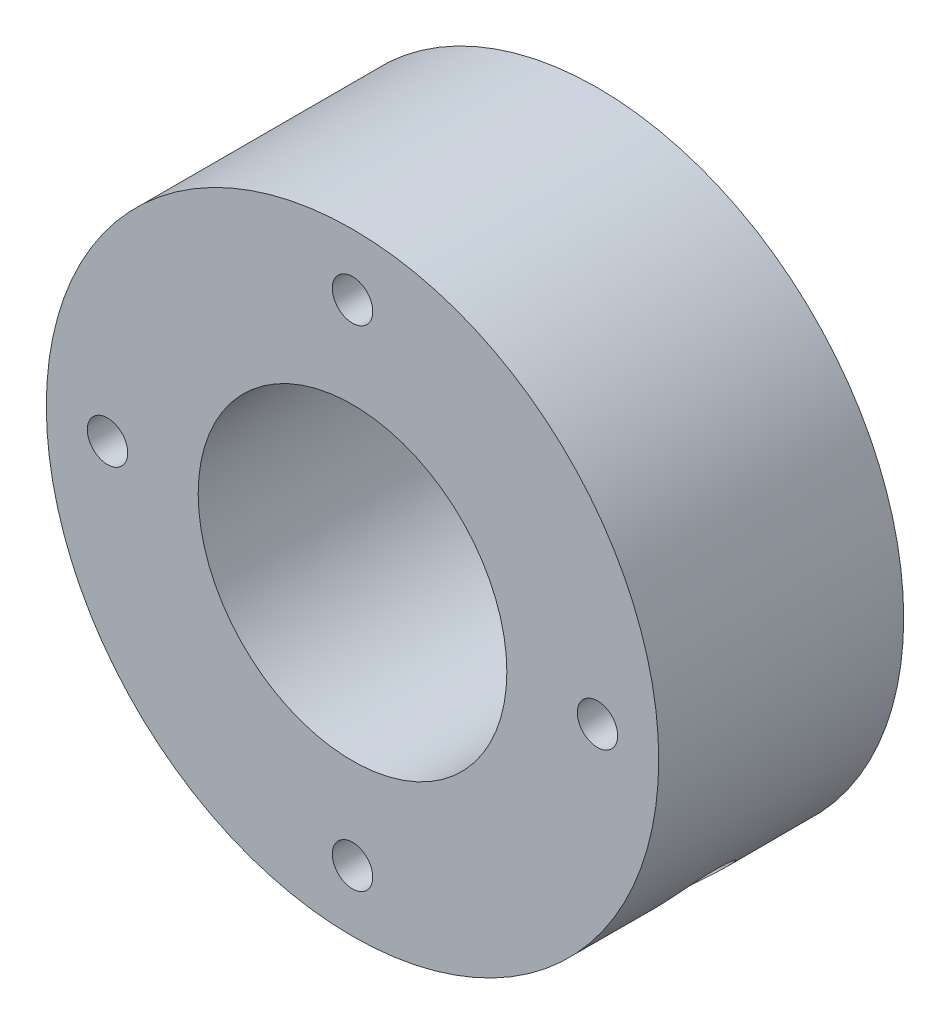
ISO-10303-21;
HEADER;
FILE_DESCRIPTION(('STEP AP214'),'2;1');
FILE_NAME('part.step','',(''),(''),'','','');
FILE_SCHEMA(('AUTOMOTIVE_DESIGN { 1 0 10303 214 1 1 1 1 }'));
ENDSEC;
DATA;
#1=APPLICATION_CONTEXT('core data for automotive mechanical design processes');
#2=APPLICATION_PROTOCOL_DEFINITION('international standard','automotive_design',2000,#1);
#3=PRODUCT_CONTEXT('',#1,'mechanical');
#4=PRODUCT('Part','Part','',(#3));
#5=PRODUCT_RELATED_PRODUCT_CATEGORY('part','',(#4));
#6=PRODUCT_DEFINITION_FORMATION('','',#4);
#7=PRODUCT_DEFINITION_CONTEXT('part definition',#1,'design');
#8=PRODUCT_DEFINITION('design','',#6,#7);
#9=PRODUCT_DEFINITION_SHAPE('','',#8);
#10=(LENGTH_UNIT() NAMED_UNIT(*) SI_UNIT(.MILLI.,.METRE.));
#11=(NAMED_UNIT(*) PLANE_ANGLE_UNIT() SI_UNIT($,.RADIAN.));
#12=(NAMED_UNIT(*) SI_UNIT($,.STERADIAN.) SOLID_ANGLE_UNIT());
#13=UNCERTAINTY_MEASURE_WITH_UNIT(LENGTH_MEASURE(1.E-05),#10,'distance_accuracy_value','');
#14=(GEOMETRIC_REPRESENTATION_CONTEXT(3) GLOBAL_UNCERTAINTY_ASSIGNED_CONTEXT((#13)) GLOBAL_UNIT_ASSIGNED_CONTEXT((#10,
#11,#12)) REPRESENTATION_CONTEXT('',''));
#15=CARTESIAN_POINT('',(0.,0.,0.));
#16=DIRECTION('',(0.,0.,1.));
#17=DIRECTION('',(1.,0.,0.));
#18=AXIS2_PLACEMENT_3D('',#15,#16,#17);
#19=CARTESIAN_POINT('',(0.,0.,20.));
#20=DIRECTION('',(0.,0.,1.));
#21=DIRECTION('',(1.,0.,0.));
#22=AXIS2_PLACEMENT_3D('',#19,#20,#21);
#23=PLANE('',#22);
#24=CARTESIAN_POINT('',(-20.,0.,20.));
#25=DIRECTION('',(0.,0.,1.));
#26=DIRECTION('',(1.,0.,0.));
#27=AXIS2_PLACEMENT_3D('',#24,#25,#26);
#28=CIRCLE('',#27,1.65);
#29=CARTESIAN_POINT('',(-18.35,0.,20.));
#30=VERTEX_POINT('',#29);
#31=EDGE_CURVE('E74',#30,#30,#28,.T.);
#32=ORIENTED_EDGE('',*,*,#31,.F.);
#33=EDGE_LOOP('',(#32));
#34=FACE_BOUND('',#33,.T.);
#35=CARTESIAN_POINT('',(0.,-20.,20.));
#36=DIRECTION('',(0.,0.,1.));
#37=DIRECTION('',(1.,0.,0.));
#38=AXIS2_PLACEMENT_3D('',#35,#36,#37);
#39=CIRCLE('',#38,1.65);
#40=CARTESIAN_POINT('',(1.65,-20.,20.));
#41=VERTEX_POINT('',#40);
#42=EDGE_CURVE('E68',#41,#41,#39,.T.);
#43=ORIENTED_EDGE('',*,*,#42,.F.);
#44=EDGE_LOOP('',(#43));
#45=FACE_BOUND('',#44,.T.);
#46=CARTESIAN_POINT('',(20.,0.,20.));
#47=DIRECTION('',(0.,0.,1.));
#48=DIRECTION('',(1.,0.,0.));
#49=AXIS2_PLACEMENT_3D('',#46,#47,#48);
#50=CIRCLE('',#49,1.65);
#51=CARTESIAN_POINT('',(21.65,0.,20.));
#52=VERTEX_POINT('',#51);
#53=EDGE_CURVE('E62',#52,#52,#50,.T.);
#54=ORIENTED_EDGE('',*,*,#53,.F.);
#55=EDGE_LOOP('',(#54));
#56=FACE_BOUND('',#55,.T.);
#57=CARTESIAN_POINT('',(0.,20.,20.));
#58=DIRECTION('',(0.,0.,1.));
#59=DIRECTION('',(1.,0.,0.));
#60=AXIS2_PLACEMENT_3D('',#57,#58,#59);
#61=CIRCLE('',#60,1.65);
#62=CARTESIAN_POINT('',(1.65,20.,20.));
#63=VERTEX_POINT('',#62);
#64=EDGE_CURVE('E56',#63,#63,#61,.T.);
#65=ORIENTED_EDGE('',*,*,#64,.F.);
#66=EDGE_LOOP('',(#65));
#67=FACE_BOUND('',#66,.T.);
#68=CARTESIAN_POINT('',(0.,0.,20.));
#69=DIRECTION('',(0.,0.,1.));
#70=DIRECTION('',(1.,0.,0.));
#71=AXIS2_PLACEMENT_3D('',#68,#69,#70);
#72=CIRCLE('',#71,25.);
#73=CARTESIAN_POINT('',(25.,0.,20.));
#74=VERTEX_POINT('',#73);
#75=EDGE_CURVE('E10',#74,#74,#72,.T.);
#76=ORIENTED_EDGE('',*,*,#75,.T.);
#77=EDGE_LOOP('',(#76));
#78=FACE_BOUND('',#77,.T.);
#79=CARTESIAN_POINT('',(0.,0.,20.));
#80=DIRECTION('',(0.,0.,1.));
#81=DIRECTION('',(1.,0.,0.));
#82=AXIS2_PLACEMENT_3D('',#79,#80,#81);
#83=CIRCLE('',#82,12.6000000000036);
#84=CARTESIAN_POINT('',(12.6000000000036,0.,20.));
#85=VERTEX_POINT('',#84);
#86=EDGE_CURVE('E48',#85,#85,#83,.T.);
#87=ORIENTED_EDGE('',*,*,#86,.F.);
#88=EDGE_LOOP('',(#87));
#89=FACE_BOUND('',#88,.T.);
#90=ADVANCED_FACE('F30',(#34,#45,#56,#67,#78,#89),#23,.T.);
#91=CARTESIAN_POINT('',(0.,0.,0.));
#92=DIRECTION('',(0.,0.,1.));
#93=DIRECTION('',(1.,0.,0.));
#94=AXIS2_PLACEMENT_3D('',#91,#92,#93);
#95=PLANE('',#94);
#96=CARTESIAN_POINT('',(0.,0.,0.));
#97=DIRECTION('',(0.,0.,1.));
#98=DIRECTION('',(1.,0.,0.));
#99=AXIS2_PLACEMENT_3D('',#96,#97,#98);
#100=CIRCLE('',#99,25.);
#101=CARTESIAN_POINT('',(25.,0.,0.));
#102=VERTEX_POINT('',#101);
#103=EDGE_CURVE('E43',#102,#102,#100,.T.);
#104=ORIENTED_EDGE('',*,*,#103,.F.);
#105=EDGE_LOOP('',(#104));
#106=FACE_BOUND('',#105,.T.);
#107=CARTESIAN_POINT('',(0.,0.,0.));
#108=DIRECTION('',(0.,0.,1.));
#109=DIRECTION('',(1.,0.,0.));
#110=AXIS2_PLACEMENT_3D('',#107,#108,#109);
#111=CIRCLE('',#110,12.6000000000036);
#112=CARTESIAN_POINT('',(12.6000000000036,0.,0.));
#113=VERTEX_POINT('',#112);
#114=EDGE_CURVE('E50',#113,#113,#111,.T.);
#115=ORIENTED_EDGE('',*,*,#114,.T.);
#116=EDGE_LOOP('',(#115));
#117=FACE_BOUND('',#116,.T.);
#118=ADVANCED_FACE('F126',(#106,#117),#95,.F.);
#119=CARTESIAN_POINT('',(0.,0.,20.));
#120=DIRECTION('',(0.,0.,-1.));
#121=DIRECTION('',(-1.,0.,0.));
#122=AXIS2_PLACEMENT_3D('',#119,#120,#121);
#123=CYLINDRICAL_SURFACE('',#122,25.);
#124=CARTESIAN_POINT('',(19.6712491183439,-15.4286084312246,10.));
#125=CARTESIAN_POINT('',(19.6712456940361,-15.4286151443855,9.83214085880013));
#126=CARTESIAN_POINT('',(19.6624706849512,-15.4398211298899,9.66417547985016));
#127=CARTESIAN_POINT('',(19.62750207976,-15.4842478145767,9.33291538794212));
#128=CARTESIAN_POINT('',(19.6012900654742,-15.5174917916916,9.16962580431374));
#129=CARTESIAN_POINT('',(19.5319302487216,-15.6047039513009,8.85256159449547));
#130=CARTESIAN_POINT('',(19.488793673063,-15.6586583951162,8.69878073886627));
#131=CARTESIAN_POINT('',(19.3863779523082,-15.7852763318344,8.40495285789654));
#132=CARTESIAN_POINT('',(19.3271016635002,-15.8579365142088,8.26490340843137));
#133=CARTESIAN_POINT('',(19.1931983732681,-16.0197435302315,8.0017602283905));
#134=CARTESIAN_POINT('',(19.1185018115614,-16.1089648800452,7.87874770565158));
#135=CARTESIAN_POINT('',(18.9553987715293,-16.3005722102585,7.65387128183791));
#136=CARTESIAN_POINT('',(18.8669916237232,-16.4029588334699,7.55200841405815));
#137=CARTESIAN_POINT('',(18.6780537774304,-16.6177856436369,7.37203346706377));
#138=CARTESIAN_POINT('',(18.5774870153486,-16.7302554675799,7.29399458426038));
#139=CARTESIAN_POINT('',(18.3667824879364,-16.9613006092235,7.16435153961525));
#140=CARTESIAN_POINT('',(18.2566450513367,-17.0798757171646,7.11274647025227));
#141=CARTESIAN_POINT('',(18.03013863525,-17.3188063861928,7.03767774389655));
#142=CARTESIAN_POINT('',(17.9138023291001,-17.4391505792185,7.01407934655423));
#143=CARTESIAN_POINT('',(17.6775782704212,-17.6785604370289,6.99527640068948));
#144=CARTESIAN_POINT('',(17.5576906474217,-17.7976261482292,7.00007081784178));
#145=CARTESIAN_POINT('',(17.3184583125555,-18.0304945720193,7.03780912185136));
#146=CARTESIAN_POINT('',(17.199113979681,-18.1443212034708,7.07060810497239));
#147=CARTESIAN_POINT('',(16.963947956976,-18.3643791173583,7.163198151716));
#148=CARTESIAN_POINT('',(16.8481263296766,-18.4706102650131,7.22298969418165));
#149=CARTESIAN_POINT('',(16.6233568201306,-18.6731619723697,7.36802272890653));
#150=CARTESIAN_POINT('',(16.5144267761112,-18.7694571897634,7.45332723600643));
#151=CARTESIAN_POINT('',(16.3072960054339,-18.9496959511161,7.64691889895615));
#152=CARTESIAN_POINT('',(16.2090957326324,-19.0336389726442,7.75520702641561));
#153=CARTESIAN_POINT('',(16.0261533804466,-19.1879349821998,7.99250434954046));
#154=CARTESIAN_POINT('',(15.9414999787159,-19.2581990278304,8.1216397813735));
#155=CARTESIAN_POINT('',(15.7893950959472,-19.3831039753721,8.39653151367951));
#156=CARTESIAN_POINT('',(15.7219436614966,-19.4377448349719,8.54228785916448));
#157=CARTESIAN_POINT('',(15.6066969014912,-19.5303995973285,8.84639249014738));
#158=CARTESIAN_POINT('',(15.5589088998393,-19.5684073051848,9.00474544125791));
#159=CARTESIAN_POINT('',(15.4848484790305,-19.627066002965,9.32949235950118));
#160=CARTESIAN_POINT('',(15.4585751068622,-19.6477177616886,9.4958859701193));
#161=CARTESIAN_POINT('',(15.4286617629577,-19.6712165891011,9.83088309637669));
#162=CARTESIAN_POINT('',(15.4248820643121,-19.6741735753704,9.99946643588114));
#163=CARTESIAN_POINT('',(15.4397298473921,-19.6625234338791,10.3350287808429));
#164=CARTESIAN_POINT('',(15.4583568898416,-19.64791665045,10.5020078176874));
#165=CARTESIAN_POINT('',(15.5172014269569,-19.6014755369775,10.829095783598));
#166=CARTESIAN_POINT('',(15.55735202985,-19.5696945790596,10.9892243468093));
#167=CARTESIAN_POINT('',(15.6576839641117,-19.489510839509,11.298679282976));
#168=CARTESIAN_POINT('',(15.7178659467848,-19.441107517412,11.448005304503));
#169=CARTESIAN_POINT('',(15.8563998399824,-19.3282842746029,11.7324162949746));
#170=CARTESIAN_POINT('',(15.9348389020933,-19.2637874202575,11.8674282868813));
#171=CARTESIAN_POINT('',(16.1069402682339,-19.1201205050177,12.1186351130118));
#172=CARTESIAN_POINT('',(16.2006031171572,-19.0409499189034,12.2348292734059));
#173=CARTESIAN_POINT('',(16.4004726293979,-18.8690732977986,12.4457197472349));
#174=CARTESIAN_POINT('',(16.5067424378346,-18.7762985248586,12.5403002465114));
#175=CARTESIAN_POINT('',(16.7278772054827,-18.5795585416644,12.7044782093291));
#176=CARTESIAN_POINT('',(16.8427420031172,-18.4755935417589,12.7740761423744));
#177=CARTESIAN_POINT('',(17.0770592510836,-18.2592275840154,12.8861210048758));
#178=CARTESIAN_POINT('',(17.196499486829,-18.1468484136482,12.9286355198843));
#179=CARTESIAN_POINT('',(17.4365252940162,-17.9163404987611,12.9855267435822));
#180=CARTESIAN_POINT('',(17.5571108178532,-17.7982119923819,12.9999046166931));
#181=CARTESIAN_POINT('',(17.7950996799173,-17.5602553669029,13.0000938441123));
#182=CARTESIAN_POINT('',(17.9125182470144,-17.4404425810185,12.9860840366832));
#183=CARTESIAN_POINT('',(18.1417159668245,-17.2019042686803,12.9302735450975));
#184=CARTESIAN_POINT('',(18.2534951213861,-17.0831787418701,12.8884728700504));
#185=CARTESIAN_POINT('',(18.4685178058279,-16.8504884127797,12.7783219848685));
#186=CARTESIAN_POINT('',(18.5717638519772,-16.7365222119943,12.7099796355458));
#187=CARTESIAN_POINT('',(18.7673314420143,-16.5169281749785,12.5487039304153));
#188=CARTESIAN_POINT('',(18.859652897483,-16.4113004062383,12.4557703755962));
#189=CARTESIAN_POINT('',(19.0319016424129,-16.2112392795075,12.2472863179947));
#190=CARTESIAN_POINT('',(19.1117507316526,-16.1168773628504,12.1316026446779));
#191=CARTESIAN_POINT('',(19.2567818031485,-15.9433115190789,11.8811769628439));
#192=CARTESIAN_POINT('',(19.321960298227,-15.8641111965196,11.7464304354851));
#193=CARTESIAN_POINT('',(19.4365853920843,-15.7234676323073,11.461157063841));
#194=CARTESIAN_POINT('',(19.4859750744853,-15.6620887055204,11.3105756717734));
#195=CARTESIAN_POINT('',(19.5677449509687,-15.5598098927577,10.998382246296));
#196=CARTESIAN_POINT('',(19.6001437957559,-15.5188875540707,10.8367825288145));
#197=CARTESIAN_POINT('',(19.6395605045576,-15.4689455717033,10.5619404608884));
#198=CARTESIAN_POINT('',(19.6514325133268,-15.4538463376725,10.4504372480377));
#199=CARTESIAN_POINT('',(19.6672779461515,-15.4336755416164,10.2259720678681));
#200=CARTESIAN_POINT('',(19.6712514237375,-15.4286039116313,10.1130101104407));
#201=CARTESIAN_POINT('',(19.6712491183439,-15.4286084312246,10.));
#202=B_SPLINE_CURVE_WITH_KNOTS('',3,(#124,#125,#126,#127,#128,#129,#130,#131,#132,#133,#134,
#135,#136,#137,#138,#139,#140,#141,#142,#143,#144,#145,#146,#147,#148,#149,#150,#151,#152,#153,
#154,#155,#156,#157,#158,#159,#160,#161,#162,#163,#164,#165,#166,#167,#168,#169,#170,#171,#172,
#173,#174,#175,#176,#177,#178,#179,#180,#181,#182,#183,#184,#185,#186,#187,#188,#189,#190,#191,
#192,#193,#194,#195,#196,#197,#198,#199,#200,#201),.UNSPECIFIED.,.T.,.F.,(4,2,2,2,2,2,2,2,2,2,2,
2,2,2,2,2,2,2,2,2,2,2,2,2,2,2,2,2,2,2,2,2,2,2,2,2,2,2,4),(0.,0.503164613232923,1.00686154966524,
1.51022492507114,2.01349927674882,2.51909553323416,3.02471648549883,3.53187561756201,
4.03901733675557,4.54370917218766,5.04838262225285,5.5504604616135,6.05254720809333,
6.55588445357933,7.05924298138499,7.56577244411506,8.0723032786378,8.5790226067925,
9.08571948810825,9.58926554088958,10.0928017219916,10.5947819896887,11.0967785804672,
11.6012225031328,12.105684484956,12.6127892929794,13.119884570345,13.6257094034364,
14.1315133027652,14.6341406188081,15.1367677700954,15.6392461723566,16.1417286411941,
16.6472450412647,17.1528814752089,17.6603206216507,18.1672015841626,18.5059562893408,
18.8447086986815),.UNSPECIFIED.);
#203=CARTESIAN_POINT('',(19.6712491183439,-15.4286084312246,10.));
#204=VERTEX_POINT('',#203);
#205=EDGE_CURVE('E77',#204,#204,#202,.T.);
#206=ORIENTED_EDGE('',*,*,#205,.T.);
#207=EDGE_LOOP('',(#206));
#208=FACE_BOUND('',#207,.T.);
#209=ORIENTED_EDGE('',*,*,#75,.F.);
#210=EDGE_LOOP('',(#209));
#211=FACE_BOUND('',#210,.T.);
#212=ORIENTED_EDGE('',*,*,#103,.T.);
#213=EDGE_LOOP('',(#212));
#214=FACE_BOUND('',#213,.T.);
#215=ADVANCED_FACE('F32',(#208,#211,#214),#123,.T.);
#216=CARTESIAN_POINT('',(0.,0.,20.));
#217=DIRECTION('',(0.,0.,-1.));
#218=DIRECTION('',(-1.,0.,0.));
#219=AXIS2_PLACEMENT_3D('',#216,#217,#218);
#220=CYLINDRICAL_SURFACE('',#219,12.6000000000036);
#221=CARTESIAN_POINT('',(10.7746434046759,-6.5320027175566,10.));
#222=CARTESIAN_POINT('',(10.7746420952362,-6.53200867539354,9.83407183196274));
#223=CARTESIAN_POINT('',(10.7672884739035,-6.54418224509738,9.66808495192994));
#224=CARTESIAN_POINT('',(10.7379041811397,-6.59228184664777,9.34085947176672));
#225=CARTESIAN_POINT('',(10.7158641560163,-6.62822301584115,9.17962396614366));
#226=CARTESIAN_POINT('',(10.6572571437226,-6.72204611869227,8.86668168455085));
#227=CARTESIAN_POINT('',(10.6207077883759,-6.77990141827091,8.71496360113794));
#228=CARTESIAN_POINT('',(10.5332820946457,-6.91494111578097,8.42486849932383));
#229=CARTESIAN_POINT('',(10.4824054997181,-6.9921258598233,8.28649171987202));
#230=CARTESIAN_POINT('',(10.3655894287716,-7.16418403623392,8.0242421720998));
#231=CARTESIAN_POINT('',(10.2993954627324,-7.25935067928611,7.90067507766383));
#232=CARTESIAN_POINT('',(10.1530244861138,-7.46269123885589,7.67423918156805));
#233=CARTESIAN_POINT('',(10.0728462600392,-7.57086628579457,7.57137218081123));
#234=CARTESIAN_POINT('',(9.89834736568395,-7.79765438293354,7.38802219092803));
#235=CARTESIAN_POINT('',(9.80386149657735,-7.91638160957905,7.30783702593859));
#236=CARTESIAN_POINT('',(9.60309831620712,-8.158751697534,7.17405948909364));
#237=CARTESIAN_POINT('',(9.49682258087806,-8.28239390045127,7.12046356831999));
#238=CARTESIAN_POINT('',(9.27687888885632,-8.52796430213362,7.04235804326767));
#239=CARTESIAN_POINT('',(9.16338350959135,-8.64988203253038,7.01733000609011));
#240=CARTESIAN_POINT('',(8.93027843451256,-8.89034024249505,6.99544590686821));
#241=CARTESIAN_POINT('',(8.81066956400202,-9.00888117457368,6.99858605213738));
#242=CARTESIAN_POINT('',(8.57137513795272,-9.23679043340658,7.03257106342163));
#243=CARTESIAN_POINT('',(8.45173964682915,-9.34629541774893,7.0628566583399));
#244=CARTESIAN_POINT('',(8.21378956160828,-9.5560889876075,7.14937698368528));
#245=CARTESIAN_POINT('',(8.09547503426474,-9.65637710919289,7.20561301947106));
#246=CARTESIAN_POINT('',(7.86307261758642,-9.8465652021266,7.34290688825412));
#247=CARTESIAN_POINT('',(7.74902847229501,-9.93637104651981,7.42416884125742));
#248=CARTESIAN_POINT('',(7.53012808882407,-10.1032740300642,7.60905407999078));
#249=CARTESIAN_POINT('',(7.42527331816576,-10.1803691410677,7.71268092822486));
#250=CARTESIAN_POINT('',(7.22609297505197,-10.322739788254,7.94237140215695));
#251=CARTESIAN_POINT('',(7.13208978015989,-10.3876780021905,8.06892415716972));
#252=CARTESIAN_POINT('',(6.96145700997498,-10.5027968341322,8.33929570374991));
#253=CARTESIAN_POINT('',(6.88482809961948,-10.5529768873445,8.48311515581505));
#254=CARTESIAN_POINT('',(6.75203169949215,-10.6384377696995,8.78478842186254));
#255=CARTESIAN_POINT('',(6.69594827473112,-10.6736574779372,8.9426966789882));
#256=CARTESIAN_POINT('',(6.60741238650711,-10.7286927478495,9.26755919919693));
#257=CARTESIAN_POINT('',(6.57495539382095,-10.7485112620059,9.4345117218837));
#258=CARTESIAN_POINT('',(6.53582654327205,-10.7723483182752,9.76842261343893));
#259=CARTESIAN_POINT('',(6.52855354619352,-10.7767352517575,9.93528434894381));
#260=CARTESIAN_POINT('',(6.53848455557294,-10.7707127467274,10.267998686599));
#261=CARTESIAN_POINT('',(6.55568653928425,-10.7603045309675,10.4338513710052));
#262=CARTESIAN_POINT('',(6.61325864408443,-10.7250133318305,10.7573573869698));
#263=CARTESIAN_POINT('',(6.65328879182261,-10.7003426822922,10.9150947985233));
#264=CARTESIAN_POINT('',(6.75437088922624,-10.6368235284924,11.2206634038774));
#265=CARTESIAN_POINT('',(6.81542514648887,-10.5979734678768,11.3684935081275));
#266=CARTESIAN_POINT('',(6.95717139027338,-10.5054761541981,11.6529804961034));
#267=CARTESIAN_POINT('',(7.03819660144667,-10.4515755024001,11.789388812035));
#268=CARTESIAN_POINT('',(7.21596492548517,-10.3296390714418,12.0445111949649));
#269=CARTESIAN_POINT('',(7.31271037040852,-10.2616011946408,12.1632226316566));
#270=CARTESIAN_POINT('',(7.52056583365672,-10.1102893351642,12.3823124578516));
#271=CARTESIAN_POINT('',(7.63194965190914,-10.0267075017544,12.4822192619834));
#272=CARTESIAN_POINT('',(7.86314247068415,-9.84644323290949,12.6574598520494));
#273=CARTESIAN_POINT('',(7.98295104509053,-9.74976145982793,12.7327948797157));
#274=CARTESIAN_POINT('',(8.22582084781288,-9.54572286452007,12.8561320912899));
#275=CARTESIAN_POINT('',(8.34885319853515,-9.43844608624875,12.9043231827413));
#276=CARTESIAN_POINT('',(8.59473277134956,-9.21510302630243,12.9725818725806));
#277=CARTESIAN_POINT('',(8.7175800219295,-9.09903827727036,12.9926543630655));
#278=CARTESIAN_POINT('',(8.95614268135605,-8.86424490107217,13.0038524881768));
#279=CARTESIAN_POINT('',(9.07195915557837,-8.74565176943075,12.995677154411));
#280=CARTESIAN_POINT('',(9.29641605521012,-8.50667538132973,12.9521979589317));
#281=CARTESIAN_POINT('',(9.40505665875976,-8.38629216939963,12.9168947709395));
#282=CARTESIAN_POINT('',(9.61212117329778,-8.14812489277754,12.8205218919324));
#283=CARTESIAN_POINT('',(9.71058853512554,-8.03033162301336,12.7595679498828));
#284=CARTESIAN_POINT('',(9.89603052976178,-7.80066609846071,12.6137310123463));
#285=CARTESIAN_POINT('',(9.98300383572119,-7.6887945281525,12.5288452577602));
#286=CARTESIAN_POINT('',(10.1460125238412,-7.47242936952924,12.3353640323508));
#287=CARTESIAN_POINT('',(10.2217646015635,-7.36815272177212,12.2262872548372));
#288=CARTESIAN_POINT('',(10.3592042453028,-7.17363951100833,11.9884693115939));
#289=CARTESIAN_POINT('',(10.4208883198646,-7.08340643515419,11.8597232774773));
#290=CARTESIAN_POINT('',(10.5306081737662,-6.91926467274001,11.5836646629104));
#291=CARTESIAN_POINT('',(10.5784019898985,-6.84564987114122,11.4360808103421));
#292=CARTESIAN_POINT('',(10.6586320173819,-6.72005639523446,11.1281667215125));
#293=CARTESIAN_POINT('',(10.6910801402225,-6.6680609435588,10.9678464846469));
#294=CARTESIAN_POINT('',(10.7353790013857,-6.59643880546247,10.6730169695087));
#295=CARTESIAN_POINT('',(10.750096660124,-6.57234937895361,10.5399985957));
#296=CARTESIAN_POINT('',(10.7697290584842,-6.54012945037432,10.2713331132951));
#297=CARTESIAN_POINT('',(10.7746444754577,-6.5319978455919,10.1356861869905));
#298=CARTESIAN_POINT('',(10.7746434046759,-6.5320027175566,10.));
#299=B_SPLINE_CURVE_WITH_KNOTS('',3,(#221,#222,#223,#224,#225,#226,#227,#228,#229,#230,#231,
#232,#233,#234,#235,#236,#237,#238,#239,#240,#241,#242,#243,#244,#245,#246,#247,#248,#249,#250,
#251,#252,#253,#254,#255,#256,#257,#258,#259,#260,#261,#262,#263,#264,#265,#266,#267,#268,#269,
#270,#271,#272,#273,#274,#275,#276,#277,#278,#279,#280,#281,#282,#283,#284,#285,#286,#287,#288,
#289,#290,#291,#292,#293,#294,#295,#296,#297,#298),.UNSPECIFIED.,.T.,.F.,(4,2,2,2,2,2,2,2,2,2,2,
2,2,2,2,2,2,2,2,2,2,2,2,2,2,2,2,2,2,2,2,2,2,2,2,2,2,2,4),(0.,0.49728663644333,0.994890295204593,
1.49189110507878,1.98890081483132,2.49485077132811,3.00084472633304,3.51320315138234,
4.02549317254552,4.52833078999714,5.03110070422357,5.52374439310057,6.01641286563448,
6.51321118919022,7.01008870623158,7.5191864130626,8.02830360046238,8.539481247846,
9.05056087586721,9.54935368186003,10.0481052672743,10.5396161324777,11.031180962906,
11.5315806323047,12.0320546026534,12.543767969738,13.0554554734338,13.5635364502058,
14.0715290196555,14.5670415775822,15.0625418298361,15.5558297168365,16.0491744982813,
16.5533920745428,17.0577346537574,17.5703980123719,18.082662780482,18.4893423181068,
18.8959937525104),.UNSPECIFIED.);
#300=CARTESIAN_POINT('',(10.7746434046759,-6.5320027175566,10.));
#301=VERTEX_POINT('',#300);
#302=EDGE_CURVE('E35',#301,#301,#299,.T.);
#303=ORIENTED_EDGE('',*,*,#302,.F.);
#304=EDGE_LOOP('',(#303));
#305=FACE_BOUND('',#304,.T.);
#306=ORIENTED_EDGE('',*,*,#86,.T.);
#307=EDGE_LOOP('',(#306));
#308=FACE_BOUND('',#307,.T.);
#309=ORIENTED_EDGE('',*,*,#114,.F.);
#310=EDGE_LOOP('',(#309));
#311=FACE_BOUND('',#310,.T.);
#312=ADVANCED_FACE('F119',(#305,#308,#311),#220,.F.);
#313=CARTESIAN_POINT('',(0.,20.,5.));
#314=DIRECTION('',(0.,0.,1.));
#315=DIRECTION('',(1.,0.,0.));
#316=AXIS2_PLACEMENT_3D('',#313,#314,#315);
#317=CYLINDRICAL_SURFACE('',#316,1.65);
#318=CARTESIAN_POINT('',(0.,20.,5.));
#319=DIRECTION('',(0.,0.,1.));
#320=DIRECTION('',(1.,0.,0.));
#321=AXIS2_PLACEMENT_3D('',#318,#319,#320);
#322=CIRCLE('',#321,1.65);
#323=CARTESIAN_POINT('',(1.65,20.,5.));
#324=VERTEX_POINT('',#323);
#325=EDGE_CURVE('E53',#324,#324,#322,.T.);
#326=ORIENTED_EDGE('',*,*,#325,.F.);
#327=EDGE_LOOP('',(#326));
#328=FACE_BOUND('',#327,.T.);
#329=ORIENTED_EDGE('',*,*,#64,.T.);
#330=EDGE_LOOP('',(#329));
#331=FACE_BOUND('',#330,.T.);
#332=ADVANCED_FACE('F116',(#328,#331),#317,.F.);
#333=CARTESIAN_POINT('',(0.,20.,5.));
#334=DIRECTION('',(0.,0.,1.));
#335=DIRECTION('',(1.,0.,0.));
#336=AXIS2_PLACEMENT_3D('',#333,#334,#335);
#337=PLANE('',#336);
#338=ORIENTED_EDGE('',*,*,#325,.T.);
#339=EDGE_LOOP('',(#338));
#340=FACE_BOUND('',#339,.T.);
#341=ADVANCED_FACE('F112',(#340),#337,.T.);
#342=CARTESIAN_POINT('',(20.,0.,5.));
#343=DIRECTION('',(0.,0.,1.));
#344=DIRECTION('',(1.,0.,0.));
#345=AXIS2_PLACEMENT_3D('',#342,#343,#344);
#346=CYLINDRICAL_SURFACE('',#345,1.65);
#347=CARTESIAN_POINT('',(20.,0.,5.));
#348=DIRECTION('',(0.,0.,1.));
#349=DIRECTION('',(1.,0.,0.));
#350=AXIS2_PLACEMENT_3D('',#347,#348,#349);
#351=CIRCLE('',#350,1.65);
#352=CARTESIAN_POINT('',(21.65,0.,5.));
#353=VERTEX_POINT('',#352);
#354=EDGE_CURVE('E59',#353,#353,#351,.T.);
#355=ORIENTED_EDGE('',*,*,#354,.F.);
#356=EDGE_LOOP('',(#355));
#357=FACE_BOUND('',#356,.T.);
#358=ORIENTED_EDGE('',*,*,#53,.T.);
#359=EDGE_LOOP('',(#358));
#360=FACE_BOUND('',#359,.T.);
#361=ADVANCED_FACE('F108',(#357,#360),#346,.F.);
#362=CARTESIAN_POINT('',(20.,0.,5.));
#363=DIRECTION('',(0.,0.,1.));
#364=DIRECTION('',(1.,0.,0.));
#365=AXIS2_PLACEMENT_3D('',#362,#363,#364);
#366=PLANE('',#365);
#367=ORIENTED_EDGE('',*,*,#354,.T.);
#368=EDGE_LOOP('',(#367));
#369=FACE_BOUND('',#368,.T.);
#370=ADVANCED_FACE('F104',(#369),#366,.T.);
#371=CARTESIAN_POINT('',(0.,-20.,5.));
#372=DIRECTION('',(0.,0.,1.));
#373=DIRECTION('',(1.,0.,0.));
#374=AXIS2_PLACEMENT_3D('',#371,#372,#373);
#375=CYLINDRICAL_SURFACE('',#374,1.65);
#376=CARTESIAN_POINT('',(0.,-20.,5.));
#377=DIRECTION('',(0.,0.,1.));
#378=DIRECTION('',(1.,0.,0.));
#379=AXIS2_PLACEMENT_3D('',#376,#377,#378);
#380=CIRCLE('',#379,1.65);
#381=CARTESIAN_POINT('',(1.65,-20.,5.));
#382=VERTEX_POINT('',#381);
#383=EDGE_CURVE('E65',#382,#382,#380,.T.);
#384=ORIENTED_EDGE('',*,*,#383,.F.);
#385=EDGE_LOOP('',(#384));
#386=FACE_BOUND('',#385,.T.);
#387=ORIENTED_EDGE('',*,*,#42,.T.);
#388=EDGE_LOOP('',(#387));
#389=FACE_BOUND('',#388,.T.);
#390=ADVANCED_FACE('F100',(#386,#389),#375,.F.);
#391=CARTESIAN_POINT('',(0.,-20.,5.));
#392=DIRECTION('',(0.,0.,1.));
#393=DIRECTION('',(1.,0.,0.));
#394=AXIS2_PLACEMENT_3D('',#391,#392,#393);
#395=PLANE('',#394);
#396=ORIENTED_EDGE('',*,*,#383,.T.);
#397=EDGE_LOOP('',(#396));
#398=FACE_BOUND('',#397,.T.);
#399=ADVANCED_FACE('F96',(#398),#395,.T.);
#400=CARTESIAN_POINT('',(-20.,0.,5.));
#401=DIRECTION('',(0.,0.,1.));
#402=DIRECTION('',(1.,0.,0.));
#403=AXIS2_PLACEMENT_3D('',#400,#401,#402);
#404=CYLINDRICAL_SURFACE('',#403,1.65);
#405=CARTESIAN_POINT('',(-20.,0.,5.));
#406=DIRECTION('',(0.,0.,1.));
#407=DIRECTION('',(1.,0.,0.));
#408=AXIS2_PLACEMENT_3D('',#405,#406,#407);
#409=CIRCLE('',#408,1.65);
#410=CARTESIAN_POINT('',(-18.35,0.,5.));
#411=VERTEX_POINT('',#410);
#412=EDGE_CURVE('E71',#411,#411,#409,.T.);
#413=ORIENTED_EDGE('',*,*,#412,.F.);
#414=EDGE_LOOP('',(#413));
#415=FACE_BOUND('',#414,.T.);
#416=ORIENTED_EDGE('',*,*,#31,.T.);
#417=EDGE_LOOP('',(#416));
#418=FACE_BOUND('',#417,.T.);
#419=ADVANCED_FACE('F92',(#415,#418),#404,.F.);
#420=CARTESIAN_POINT('',(-20.,0.,5.));
#421=DIRECTION('',(0.,0.,1.));
#422=DIRECTION('',(1.,0.,0.));
#423=AXIS2_PLACEMENT_3D('',#420,#421,#422);
#424=PLANE('',#423);
#425=ORIENTED_EDGE('',*,*,#412,.T.);
#426=EDGE_LOOP('',(#425));
#427=FACE_BOUND('',#426,.T.);
#428=ADVANCED_FACE('F87',(#427),#424,.T.);
#429=CARTESIAN_POINT('',(7.07106781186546,-7.07106781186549,10.));
#430=DIRECTION('',(0.707106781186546,-0.707106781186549,0.));
#431=DIRECTION('',(0.707106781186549,0.707106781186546,0.));
#432=AXIS2_PLACEMENT_3D('',#429,#430,#431);
#433=CYLINDRICAL_SURFACE('',#432,3.);
#434=ORIENTED_EDGE('',*,*,#302,.T.);
#435=EDGE_LOOP('',(#434));
#436=FACE_BOUND('',#435,.T.);
#437=ORIENTED_EDGE('',*,*,#205,.F.);
#438=EDGE_LOOP('',(#437));
#439=FACE_BOUND('',#438,.T.);
#440=ADVANCED_FACE('F83',(#436,#439),#433,.F.);
#441=CLOSED_SHELL('',(#90,#118,#215,#312,#332,#341,#361,#370,#390,#399,#419,#428,#440));
#442=MANIFOLD_SOLID_BREP('B2',#441);
#443=ADVANCED_BREP_SHAPE_REPRESENTATION('',(#18,#442),#14);
#444=SHAPE_DEFINITION_REPRESENTATION(#9,#443);
ENDSEC;
END-ISO-10303-21;
